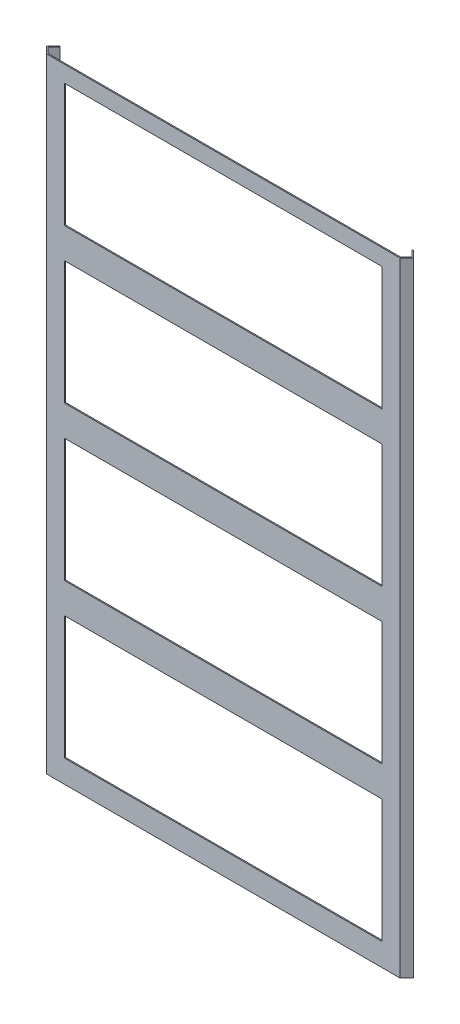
from build123d import *

# Parameters (mm, degrees)
ESQUISSE1_W        = 1290
ESQUISSE1_H        = 2276
ESQUISSE1_W_2      = 1160
ESQUISSE1_H_2      = 450
BOSS_EXTRU_1_DEPTH = 4
EXTRU_MINCE2_DEPTH = 2276
EXTRU_MINCE3_DEPTH = 2276


with BuildPart() as part:
    # Esquisse1 → Boss.-Extru.1 (new body)
    with BuildSketch(Plane.XY):
        with Locations((645, 1138)):
            Rectangle(ESQUISSE1_W, ESQUISSE1_H)
        with Locations((645, 308)):
            Rectangle(ESQUISSE1_W_2, ESQUISSE1_H_2, mode=Mode.SUBTRACT)
        with Locations((645, 869)):
            Rectangle(ESQUISSE1_W_2, ESQUISSE1_H_2, mode=Mode.SUBTRACT)
        with Locations((645, 1430)):
            Rectangle(ESQUISSE1_W_2, ESQUISSE1_H_2, mode=Mode.SUBTRACT)
        with Locations((645, 1991)):
            Rectangle(ESQUISSE1_W_2, ESQUISSE1_H_2, mode=Mode.SUBTRACT)
    extrude(amount=BOSS_EXTRU_1_DEPTH)

    # Esquisse2 → Extru.-Mince2 (add)
    with BuildSketch(Plane(origin=(0, 2276, 0), x_dir=(1, 0, 0), z_dir=(0, 1, 0))):
        Polygon((0, -4), (-24.748737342, 20.748737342), (0, 45.497474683), (2.828427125, 42.669047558), (-19.091883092, 20.748737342), (2.828427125, -1.171572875), align=None)
    extrude(amount=-EXTRU_MINCE2_DEPTH)

    # Esquisse2_3 → Extru.-Mince3 (add)
    with BuildSketch(Plane(origin=(0, 2276, 0), x_dir=(1, 0, 0), z_dir=(0, 1, 0))):
        Polygon((1290, -4), (1314.748737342, 20.748737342), (1290, 45.497474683), (1287.171572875, 42.669047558), (1309.091883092, 20.748737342), (1287.171572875, -1.171572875), align=None)
    extrude(amount=-EXTRU_MINCE3_DEPTH)


solid = part.part
